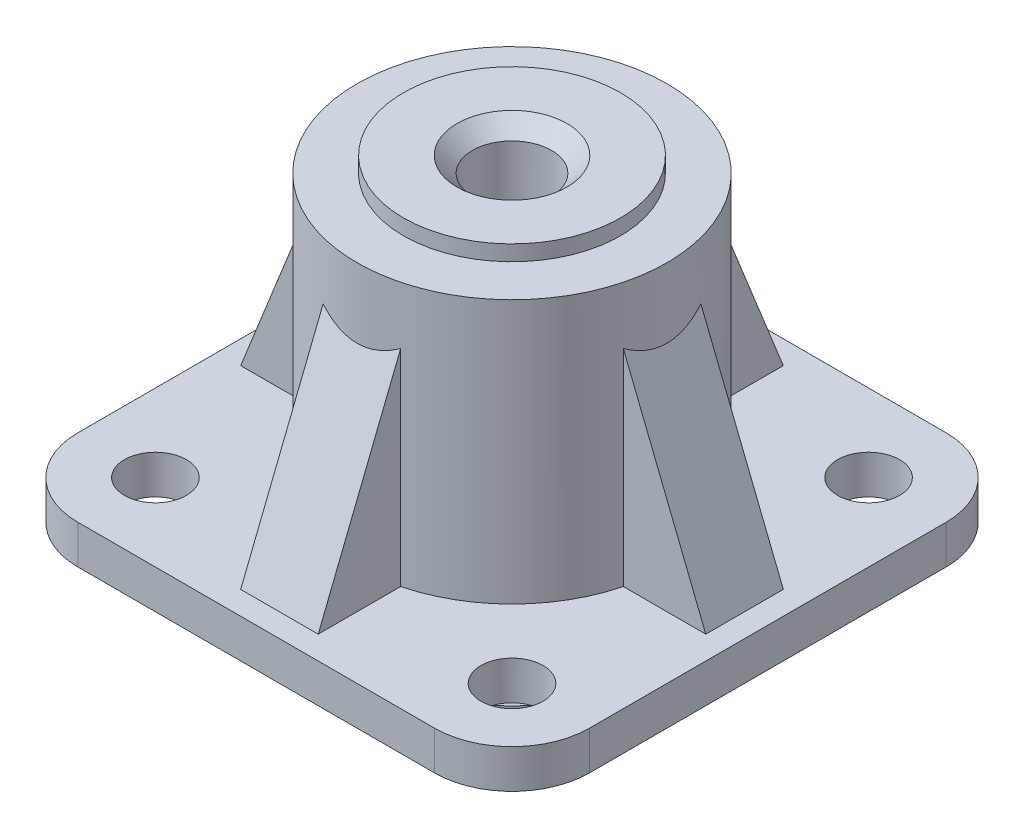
ISO-10303-21;
HEADER;
FILE_DESCRIPTION(('STEP AP214'),'2;1');
FILE_NAME('part.step','',(''),(''),'','','');
FILE_SCHEMA(('AUTOMOTIVE_DESIGN { 1 0 10303 214 1 1 1 1 }'));
ENDSEC;
DATA;
#1=APPLICATION_CONTEXT('core data for automotive mechanical design processes');
#2=APPLICATION_PROTOCOL_DEFINITION('international standard','automotive_design',2000,#1);
#3=PRODUCT_CONTEXT('',#1,'mechanical');
#4=PRODUCT('Part','Part','',(#3));
#5=PRODUCT_RELATED_PRODUCT_CATEGORY('part','',(#4));
#6=PRODUCT_DEFINITION_FORMATION('','',#4);
#7=PRODUCT_DEFINITION_CONTEXT('part definition',#1,'design');
#8=PRODUCT_DEFINITION('design','',#6,#7);
#9=PRODUCT_DEFINITION_SHAPE('','',#8);
#10=(LENGTH_UNIT() NAMED_UNIT(*) SI_UNIT(.MILLI.,.METRE.));
#11=(NAMED_UNIT(*) PLANE_ANGLE_UNIT() SI_UNIT($,.RADIAN.));
#12=(NAMED_UNIT(*) SI_UNIT($,.STERADIAN.) SOLID_ANGLE_UNIT());
#13=UNCERTAINTY_MEASURE_WITH_UNIT(LENGTH_MEASURE(1.E-05),#10,'distance_accuracy_value','');
#14=(GEOMETRIC_REPRESENTATION_CONTEXT(3) GLOBAL_UNCERTAINTY_ASSIGNED_CONTEXT((#13)) GLOBAL_UNIT_ASSIGNED_CONTEXT((#10,
#11,#12)) REPRESENTATION_CONTEXT('',''));
#15=CARTESIAN_POINT('',(0.,0.,0.));
#16=DIRECTION('',(0.,0.,1.));
#17=DIRECTION('',(1.,0.,0.));
#18=AXIS2_PLACEMENT_3D('',#15,#16,#17);
#19=CARTESIAN_POINT('',(-23.,10.,23.));
#20=DIRECTION('',(0.,1.,0.));
#21=DIRECTION('',(0.,0.,1.));
#22=AXIS2_PLACEMENT_3D('',#19,#20,#21);
#23=PLANE('',#22);
#24=CARTESIAN_POINT('',(0.,9.99999999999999,0.));
#25=DIRECTION('',(0.,1.,0.));
#26=DIRECTION('',(0.,0.,1.));
#27=AXIS2_PLACEMENT_3D('',#24,#25,#26);
#28=CIRCLE('',#27,4.005);
#29=CARTESIAN_POINT('',(0.,9.99999999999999,-4.005));
#30=VERTEX_POINT('',#29);
#31=EDGE_CURVE('E659',#30,#30,#28,.F.);
#32=ORIENTED_EDGE('',*,*,#31,.T.);
#33=EDGE_LOOP('',(#32));
#34=FACE_BOUND('',#33,.T.);
#35=CARTESIAN_POINT('',(0.,10.,0.));
#36=DIRECTION('',(0.,1.,0.));
#37=DIRECTION('',(0.,0.,1.));
#38=AXIS2_PLACEMENT_3D('',#35,#36,#37);
#39=CIRCLE('',#38,15.);
#40=CARTESIAN_POINT('',(0.,10.,15.));
#41=VERTEX_POINT('',#40);
#42=EDGE_CURVE('E430',#41,#41,#39,.T.);
#43=ORIENTED_EDGE('',*,*,#42,.T.);
#44=EDGE_LOOP('',(#43));
#45=FACE_BOUND('',#44,.T.);
#46=ADVANCED_FACE('F44',(#34,#45),#23,.T.);
#47=CARTESIAN_POINT('',(10.,30.,0.));
#48=DIRECTION('',(0.,-1.,0.));
#49=DIRECTION('',(0.,0.,-1.));
#50=AXIS2_PLACEMENT_3D('',#47,#48,#49);
#51=PLANE('',#50);
#52=CARTESIAN_POINT('',(0.,30.,0.));
#53=DIRECTION('',(0.,-1.,0.));
#54=DIRECTION('',(0.,0.,-1.));
#55=AXIS2_PLACEMENT_3D('',#52,#53,#54);
#56=CIRCLE('',#55,5.09999999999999);
#57=CARTESIAN_POINT('',(0.,30.,-5.09999999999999));
#58=VERTEX_POINT('',#57);
#59=EDGE_CURVE('E296',#58,#58,#56,.T.);
#60=ORIENTED_EDGE('',*,*,#59,.F.);
#61=EDGE_LOOP('',(#60));
#62=FACE_BOUND('',#61,.T.);
#63=CARTESIAN_POINT('',(0.,30.,0.));
#64=DIRECTION('',(0.,-1.,0.));
#65=DIRECTION('',(0.,0.,-1.));
#66=AXIS2_PLACEMENT_3D('',#63,#64,#65);
#67=CIRCLE('',#66,10.);
#68=CARTESIAN_POINT('',(0.,30.,-10.));
#69=VERTEX_POINT('',#68);
#70=EDGE_CURVE('E395',#69,#69,#67,.T.);
#71=ORIENTED_EDGE('',*,*,#70,.T.);
#72=EDGE_LOOP('',(#71));
#73=FACE_BOUND('',#72,.T.);
#74=ADVANCED_FACE('F474',(#62,#73),#51,.T.);
#75=CARTESIAN_POINT('',(0.,0.,0.));
#76=DIRECTION('',(0.,-1.,0.));
#77=DIRECTION('',(0.,0.,-1.));
#78=AXIS2_PLACEMENT_3D('',#75,#76,#77);
#79=CYLINDRICAL_SURFACE('',#78,10.);
#80=CARTESIAN_POINT('',(0.,34.,0.));
#81=DIRECTION('',(0.,-1.,0.));
#82=DIRECTION('',(0.,0.,-1.));
#83=AXIS2_PLACEMENT_3D('',#80,#81,#82);
#84=CIRCLE('',#83,10.);
#85=CARTESIAN_POINT('',(0.,34.,-10.));
#86=VERTEX_POINT('',#85);
#87=EDGE_CURVE('E398',#86,#86,#84,.T.);
#88=ORIENTED_EDGE('',*,*,#87,.T.);
#89=EDGE_LOOP('',(#88));
#90=FACE_BOUND('',#89,.T.);
#91=ORIENTED_EDGE('',*,*,#70,.F.);
#92=EDGE_LOOP('',(#91));
#93=FACE_BOUND('',#92,.T.);
#94=ADVANCED_FACE('F479',(#90,#93),#79,.T.);
#95=CARTESIAN_POINT('',(10.,34.,0.));
#96=DIRECTION('',(0.,-1.,0.));
#97=DIRECTION('',(0.,0.,-1.));
#98=AXIS2_PLACEMENT_3D('',#95,#96,#97);
#99=PLANE('',#98);
#100=ORIENTED_EDGE('',*,*,#87,.F.);
#101=EDGE_LOOP('',(#100));
#102=FACE_BOUND('',#101,.T.);
#103=CARTESIAN_POINT('',(0.,34.,0.));
#104=DIRECTION('',(0.,-1.,0.));
#105=DIRECTION('',(0.,0.,-1.));
#106=AXIS2_PLACEMENT_3D('',#103,#104,#105);
#107=CIRCLE('',#106,15.);
#108=CARTESIAN_POINT('',(0.,34.,-15.));
#109=VERTEX_POINT('',#108);
#110=EDGE_CURVE('E401',#109,#109,#107,.T.);
#111=ORIENTED_EDGE('',*,*,#110,.T.);
#112=EDGE_LOOP('',(#111));
#113=FACE_BOUND('',#112,.T.);
#114=ADVANCED_FACE('F525',(#102,#113),#99,.T.);
#115=CARTESIAN_POINT('',(0.,0.,0.));
#116=DIRECTION('',(0.,-1.,0.));
#117=DIRECTION('',(0.,0.,-1.));
#118=AXIS2_PLACEMENT_3D('',#115,#116,#117);
#119=CYLINDRICAL_SURFACE('',#118,15.);
#120=ORIENTED_EDGE('',*,*,#42,.F.);
#121=EDGE_LOOP('',(#120));
#122=FACE_BOUND('',#121,.T.);
#123=ORIENTED_EDGE('',*,*,#110,.F.);
#124=EDGE_LOOP('',(#123));
#125=FACE_BOUND('',#124,.T.);
#126=ADVANCED_FACE('F529',(#122,#125),#119,.F.);
#127=CARTESIAN_POINT('',(0.,46.,0.));
#128=DIRECTION('',(0.,1.,0.));
#129=DIRECTION('',(0.,0.,1.));
#130=AXIS2_PLACEMENT_3D('',#127,#128,#129);
#131=CYLINDRICAL_SURFACE('',#130,5.09999999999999);
#132=ORIENTED_EDGE('',*,*,#59,.T.);
#133=EDGE_LOOP('',(#132));
#134=FACE_BOUND('',#133,.T.);
#135=CARTESIAN_POINT('',(0.,44.,0.));
#136=DIRECTION('',(0.,1.,0.));
#137=DIRECTION('',(0.,0.,1.));
#138=AXIS2_PLACEMENT_3D('',#135,#136,#137);
#139=CIRCLE('',#138,5.09999999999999);
#140=CARTESIAN_POINT('',(0.,44.,5.09999999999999));
#141=VERTEX_POINT('',#140);
#142=EDGE_CURVE('E53',#141,#141,#139,.T.);
#143=ORIENTED_EDGE('',*,*,#142,.T.);
#144=EDGE_LOOP('',(#143));
#145=FACE_BOUND('',#144,.T.);
#146=ADVANCED_FACE('F437',(#134,#145),#131,.F.);
#147=CARTESIAN_POINT('',(0.,46.,0.));
#148=DIRECTION('',(0.,1.,0.));
#149=DIRECTION('',(0.,0.,1.));
#150=AXIS2_PLACEMENT_3D('',#147,#148,#149);
#151=PLANE('',#150);
#152=CARTESIAN_POINT('',(0.,46.,0.));
#153=DIRECTION('',(0.,1.,0.));
#154=DIRECTION('',(0.,0.,1.));
#155=AXIS2_PLACEMENT_3D('',#152,#153,#154);
#156=CIRCLE('',#155,7.09999999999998);
#157=CARTESIAN_POINT('',(0.,46.,7.09999999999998));
#158=VERTEX_POINT('',#157);
#159=EDGE_CURVE('E11',#158,#158,#156,.F.);
#160=ORIENTED_EDGE('',*,*,#159,.T.);
#161=EDGE_LOOP('',(#160));
#162=FACE_BOUND('',#161,.T.);
#163=CARTESIAN_POINT('',(0.,46.,0.));
#164=DIRECTION('',(0.,-1.,0.));
#165=DIRECTION('',(0.,0.,-1.));
#166=AXIS2_PLACEMENT_3D('',#163,#164,#165);
#167=CIRCLE('',#166,14.);
#168=CARTESIAN_POINT('',(0.,46.,-14.));
#169=VERTEX_POINT('',#168);
#170=EDGE_CURVE('E427',#169,#169,#167,.T.);
#171=ORIENTED_EDGE('',*,*,#170,.F.);
#172=EDGE_LOOP('',(#171));
#173=FACE_BOUND('',#172,.T.);
#174=ADVANCED_FACE('F445',(#162,#173),#151,.T.);
#175=CARTESIAN_POINT('',(0.,0.,0.));
#176=DIRECTION('',(0.,-1.,0.));
#177=DIRECTION('',(0.,0.,-1.));
#178=AXIS2_PLACEMENT_3D('',#175,#176,#177);
#179=CYLINDRICAL_SURFACE('',#178,14.);
#180=ORIENTED_EDGE('',*,*,#170,.T.);
#181=EDGE_LOOP('',(#180));
#182=FACE_BOUND('',#181,.T.);
#183=CARTESIAN_POINT('',(0.,44.,0.));
#184=DIRECTION('',(0.,-1.,0.));
#185=DIRECTION('',(0.,0.,-1.));
#186=AXIS2_PLACEMENT_3D('',#183,#184,#185);
#187=CIRCLE('',#186,14.);
#188=CARTESIAN_POINT('',(0.,44.,-14.));
#189=VERTEX_POINT('',#188);
#190=EDGE_CURVE('E424',#189,#189,#187,.T.);
#191=ORIENTED_EDGE('',*,*,#190,.F.);
#192=EDGE_LOOP('',(#191));
#193=FACE_BOUND('',#192,.T.);
#194=ADVANCED_FACE('F448',(#182,#193),#179,.T.);
#195=CARTESIAN_POINT('',(14.,44.,0.));
#196=DIRECTION('',(0.,1.,0.));
#197=DIRECTION('',(0.,0.,1.));
#198=AXIS2_PLACEMENT_3D('',#195,#196,#197);
#199=PLANE('',#198);
#200=ORIENTED_EDGE('',*,*,#190,.T.);
#201=EDGE_LOOP('',(#200));
#202=FACE_BOUND('',#201,.T.);
#203=CARTESIAN_POINT('',(0.,44.,0.));
#204=DIRECTION('',(0.,-1.,0.));
#205=DIRECTION('',(0.,0.,-1.));
#206=AXIS2_PLACEMENT_3D('',#203,#204,#205);
#207=CIRCLE('',#206,20.);
#208=CARTESIAN_POINT('',(0.,44.,-20.));
#209=VERTEX_POINT('',#208);
#210=EDGE_CURVE('E420',#209,#209,#207,.T.);
#211=ORIENTED_EDGE('',*,*,#210,.F.);
#212=EDGE_LOOP('',(#211));
#213=FACE_BOUND('',#212,.T.);
#214=ADVANCED_FACE('F453',(#202,#213),#199,.T.);
#215=CARTESIAN_POINT('',(0.,0.,0.));
#216=DIRECTION('',(0.,-1.,0.));
#217=DIRECTION('',(0.,0.,-1.));
#218=AXIS2_PLACEMENT_3D('',#215,#216,#217);
#219=CYLINDRICAL_SURFACE('',#218,20.);
#220=DIRECTION('',(0.,-1.,0.));
#221=VECTOR('',#220,1.);
#222=CARTESIAN_POINT('',(5.00000000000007,0.,-19.3649167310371));
#223=LINE('',#222,#221);
#224=CARTESIAN_POINT('',(5.00000000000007,10.,-19.3649167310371));
#225=VERTEX_POINT('',#224);
#226=CARTESIAN_POINT('',(5.00000000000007,36.5896050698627,-19.3649167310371));
#227=VERTEX_POINT('',#226);
#228=EDGE_CURVE('E264',#225,#227,#223,.F.);
#229=ORIENTED_EDGE('',*,*,#228,.T.);
#230=CARTESIAN_POINT('',(0.,85.0053508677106,0.));
#231=DIRECTION('',(0.,-0.371367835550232,0.928485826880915));
#232=DIRECTION('',(0.,-0.928485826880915,-0.371367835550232));
#233=AXIS2_PLACEMENT_3D('',#230,#231,#232);
#234=ELLIPSE('',#233,53.8549601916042,20.);
#235=CARTESIAN_POINT('',(-4.99999999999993,36.5896050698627,-19.3649167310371));
#236=VERTEX_POINT('',#235);
#237=EDGE_CURVE('E273',#236,#227,#234,.T.);
#238=ORIENTED_EDGE('',*,*,#237,.F.);
#239=DIRECTION('',(0.,-1.,0.));
#240=VECTOR('',#239,1.);
#241=CARTESIAN_POINT('',(-4.99999999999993,0.,-19.3649167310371));
#242=LINE('',#241,#240);
#243=CARTESIAN_POINT('',(-4.99999999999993,10.,-19.3649167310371));
#244=VERTEX_POINT('',#243);
#245=EDGE_CURVE('E269',#244,#236,#242,.F.);
#246=ORIENTED_EDGE('',*,*,#245,.F.);
#247=CARTESIAN_POINT('',(0.,10.,0.));
#248=DIRECTION('',(0.,1.,0.));
#249=DIRECTION('',(0.,0.,1.));
#250=AXIS2_PLACEMENT_3D('',#247,#248,#249);
#251=CIRCLE('',#250,20.);
#252=CARTESIAN_POINT('',(-19.3649167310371,10.,-5.));
#253=VERTEX_POINT('',#252);
#254=EDGE_CURVE('E390',#253,#244,#251,.F.);
#255=ORIENTED_EDGE('',*,*,#254,.F.);
#256=DIRECTION('',(0.,-1.,0.));
#257=VECTOR('',#256,1.);
#258=CARTESIAN_POINT('',(-19.3649167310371,0.,-5.));
#259=LINE('',#258,#257);
#260=CARTESIAN_POINT('',(-19.3649167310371,36.5896050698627,-5.));
#261=VERTEX_POINT('',#260);
#262=EDGE_CURVE('E284',#253,#261,#259,.F.);
#263=ORIENTED_EDGE('',*,*,#262,.T.);
#264=CARTESIAN_POINT('',(0.,85.0053508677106,0.));
#265=DIRECTION('',(0.928485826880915,-0.371367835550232,0.));
#266=DIRECTION('',(-0.371367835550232,-0.928485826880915,0.));
#267=AXIS2_PLACEMENT_3D('',#264,#265,#266);
#268=ELLIPSE('',#267,53.8549601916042,20.);
#269=CARTESIAN_POINT('',(-19.3649167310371,36.5896050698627,5.));
#270=VERTEX_POINT('',#269);
#271=EDGE_CURVE('E294',#270,#261,#268,.T.);
#272=ORIENTED_EDGE('',*,*,#271,.F.);
#273=DIRECTION('',(0.,-1.,0.));
#274=VECTOR('',#273,1.);
#275=CARTESIAN_POINT('',(-19.3649167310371,0.,5.));
#276=LINE('',#275,#274);
#277=CARTESIAN_POINT('',(-19.3649167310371,10.,5.));
#278=VERTEX_POINT('',#277);
#279=EDGE_CURVE('E290',#278,#270,#276,.F.);
#280=ORIENTED_EDGE('',*,*,#279,.F.);
#281=CARTESIAN_POINT('',(-5.0000000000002,10.,19.364916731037));
#282=VERTEX_POINT('',#281);
#283=EDGE_CURVE('E394',#282,#278,#251,.F.);
#284=ORIENTED_EDGE('',*,*,#283,.F.);
#285=DIRECTION('',(0.,-1.,0.));
#286=VECTOR('',#285,1.);
#287=CARTESIAN_POINT('',(-5.0000000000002,0.,19.364916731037));
#288=LINE('',#287,#286);
#289=CARTESIAN_POINT('',(-5.0000000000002,36.5896050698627,19.364916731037));
#290=VERTEX_POINT('',#289);
#291=EDGE_CURVE('E60',#282,#290,#288,.F.);
#292=ORIENTED_EDGE('',*,*,#291,.T.);
#293=CARTESIAN_POINT('',(0.,85.0053508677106,0.));
#294=DIRECTION('',(0.,-0.371367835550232,-0.928485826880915));
#295=DIRECTION('',(0.,-0.928485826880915,0.371367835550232));
#296=AXIS2_PLACEMENT_3D('',#293,#294,#295);
#297=ELLIPSE('',#296,53.8549601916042,20.);
#298=CARTESIAN_POINT('',(4.9999999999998,36.5896050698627,19.3649167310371));
#299=VERTEX_POINT('',#298);
#300=EDGE_CURVE('E217',#299,#290,#297,.T.);
#301=ORIENTED_EDGE('',*,*,#300,.F.);
#302=DIRECTION('',(0.,-1.,0.));
#303=VECTOR('',#302,1.);
#304=CARTESIAN_POINT('',(4.9999999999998,0.,19.3649167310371));
#305=LINE('',#304,#303);
#306=CARTESIAN_POINT('',(4.9999999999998,10.,19.3649167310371));
#307=VERTEX_POINT('',#306);
#308=EDGE_CURVE('E223',#307,#299,#305,.F.);
#309=ORIENTED_EDGE('',*,*,#308,.F.);
#310=CARTESIAN_POINT('',(19.3649167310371,10.,5.));
#311=VERTEX_POINT('',#310);
#312=EDGE_CURVE('E230',#311,#307,#251,.F.);
#313=ORIENTED_EDGE('',*,*,#312,.F.);
#314=DIRECTION('',(0.,-1.,0.));
#315=VECTOR('',#314,1.);
#316=CARTESIAN_POINT('',(19.3649167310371,0.,5.));
#317=LINE('',#316,#315);
#318=CARTESIAN_POINT('',(19.3649167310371,36.5896050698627,5.));
#319=VERTEX_POINT('',#318);
#320=EDGE_CURVE('E68',#311,#319,#317,.F.);
#321=ORIENTED_EDGE('',*,*,#320,.T.);
#322=CARTESIAN_POINT('',(0.,85.0053508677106,0.));
#323=DIRECTION('',(-0.928485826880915,-0.371367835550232,0.));
#324=DIRECTION('',(0.371367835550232,-0.928485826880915,0.));
#325=AXIS2_PLACEMENT_3D('',#322,#323,#324);
#326=ELLIPSE('',#325,53.8549601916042,20.);
#327=CARTESIAN_POINT('',(19.3649167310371,36.5896050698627,-5.));
#328=VERTEX_POINT('',#327);
#329=EDGE_CURVE('E253',#328,#319,#326,.T.);
#330=ORIENTED_EDGE('',*,*,#329,.F.);
#331=DIRECTION('',(0.,-1.,0.));
#332=VECTOR('',#331,1.);
#333=CARTESIAN_POINT('',(19.3649167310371,0.,-5.));
#334=LINE('',#333,#332);
#335=CARTESIAN_POINT('',(19.3649167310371,10.,-5.));
#336=VERTEX_POINT('',#335);
#337=EDGE_CURVE('E246',#336,#328,#334,.F.);
#338=ORIENTED_EDGE('',*,*,#337,.F.);
#339=EDGE_CURVE('E393',#225,#336,#251,.F.);
#340=ORIENTED_EDGE('',*,*,#339,.F.);
#341=EDGE_LOOP('',(#229,#238,#246,#255,#263,#272,#280,#284,#292,#301,#309,#313,#321,#330,#338,#340));
#342=FACE_BOUND('',#341,.T.);
#343=ORIENTED_EDGE('',*,*,#210,.T.);
#344=EDGE_LOOP('',(#343));
#345=FACE_BOUND('',#344,.T.);
#346=ADVANCED_FACE('F459',(#342,#345),#219,.T.);
#347=DIRECTION('',(-1.,0.,0.));
#348=VECTOR('',#347,1.);
#349=CARTESIAN_POINT('',(-22.9999999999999,10.,-33.));
#350=LINE('',#349,#348);
#351=CARTESIAN_POINT('',(22.9999999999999,10.,-33.));
#352=VERTEX_POINT('',#351);
#353=CARTESIAN_POINT('',(-22.9999999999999,10.,-33.));
#354=VERTEX_POINT('',#353);
#355=EDGE_CURVE('E340',#352,#354,#350,.T.);
#356=ORIENTED_EDGE('',*,*,#355,.T.);
#357=CARTESIAN_POINT('',(-23.,10.,-23.));
#358=DIRECTION('',(0.,1.,0.));
#359=DIRECTION('',(0.,0.,1.));
#360=AXIS2_PLACEMENT_3D('',#357,#358,#359);
#361=CIRCLE('',#360,10.);
#362=CARTESIAN_POINT('',(-33.,10.,-22.9999999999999));
#363=VERTEX_POINT('',#362);
#364=EDGE_CURVE('E342',#354,#363,#361,.T.);
#365=ORIENTED_EDGE('',*,*,#364,.T.);
#366=DIRECTION('',(0.,0.,1.));
#367=VECTOR('',#366,1.);
#368=CARTESIAN_POINT('',(-33.,10.,-22.9999999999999));
#369=LINE('',#368,#367);
#370=CARTESIAN_POINT('',(-33.,10.,22.9999999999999));
#371=VERTEX_POINT('',#370);
#372=EDGE_CURVE('E344',#363,#371,#369,.T.);
#373=ORIENTED_EDGE('',*,*,#372,.T.);
#374=CARTESIAN_POINT('',(-23.,10.,23.));
#375=DIRECTION('',(0.,1.,0.));
#376=DIRECTION('',(0.,0.,1.));
#377=AXIS2_PLACEMENT_3D('',#374,#375,#376);
#378=CIRCLE('',#377,10.);
#379=CARTESIAN_POINT('',(-22.9999999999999,10.,33.));
#380=VERTEX_POINT('',#379);
#381=EDGE_CURVE('E328',#371,#380,#378,.T.);
#382=ORIENTED_EDGE('',*,*,#381,.T.);
#383=DIRECTION('',(1.,0.,0.));
#384=VECTOR('',#383,1.);
#385=CARTESIAN_POINT('',(-22.9999999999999,10.,33.));
#386=LINE('',#385,#384);
#387=CARTESIAN_POINT('',(22.9999999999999,10.,33.));
#388=VERTEX_POINT('',#387);
#389=EDGE_CURVE('E331',#380,#388,#386,.T.);
#390=ORIENTED_EDGE('',*,*,#389,.T.);
#391=CARTESIAN_POINT('',(23.,10.,23.));
#392=DIRECTION('',(0.,1.,0.));
#393=DIRECTION('',(0.,0.,1.));
#394=AXIS2_PLACEMENT_3D('',#391,#392,#393);
#395=CIRCLE('',#394,10.);
#396=CARTESIAN_POINT('',(33.,10.,22.9999999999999));
#397=VERTEX_POINT('',#396);
#398=EDGE_CURVE('E334',#388,#397,#395,.T.);
#399=ORIENTED_EDGE('',*,*,#398,.T.);
#400=DIRECTION('',(0.,0.,-1.));
#401=VECTOR('',#400,1.);
#402=CARTESIAN_POINT('',(33.,10.,-22.9999999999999));
#403=LINE('',#402,#401);
#404=CARTESIAN_POINT('',(33.,10.,-22.9999999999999));
#405=VERTEX_POINT('',#404);
#406=EDGE_CURVE('E336',#397,#405,#403,.T.);
#407=ORIENTED_EDGE('',*,*,#406,.T.);
#408=CARTESIAN_POINT('',(23.,10.,-23.));
#409=DIRECTION('',(0.,1.,0.));
#410=DIRECTION('',(0.,0.,-1.));
#411=AXIS2_PLACEMENT_3D('',#408,#409,#410);
#412=CIRCLE('',#411,10.);
#413=EDGE_CURVE('E338',#405,#352,#412,.T.);
#414=ORIENTED_EDGE('',*,*,#413,.T.);
#415=EDGE_LOOP('',(#356,#365,#373,#382,#390,#399,#407,#414));
#416=FACE_BOUND('',#415,.T.);
#417=DIRECTION('',(1.,0.,0.));
#418=VECTOR('',#417,1.);
#419=CARTESIAN_POINT('',(-22.9999999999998,10.,-30.0000000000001));
#420=LINE('',#419,#418);
#421=CARTESIAN_POINT('',(5.0000000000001,10.,-30.));
#422=VERTEX_POINT('',#421);
#423=CARTESIAN_POINT('',(-4.9999999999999,10.,-30.));
#424=VERTEX_POINT('',#423);
#425=EDGE_CURVE('E271',#422,#424,#420,.F.);
#426=ORIENTED_EDGE('',*,*,#425,.F.);
#427=DIRECTION('',(0.,0.,1.));
#428=VECTOR('',#427,1.);
#429=CARTESIAN_POINT('',(4.99999999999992,10.,23.0000000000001));
#430=LINE('',#429,#428);
#431=EDGE_CURVE('E259',#422,#225,#430,.T.);
#432=ORIENTED_EDGE('',*,*,#431,.T.);
#433=ORIENTED_EDGE('',*,*,#339,.T.);
#434=DIRECTION('',(-1.,0.,0.));
#435=VECTOR('',#434,1.);
#436=CARTESIAN_POINT('',(-23.,10.,-5.));
#437=LINE('',#436,#435);
#438=CARTESIAN_POINT('',(30.,10.,-5.));
#439=VERTEX_POINT('',#438);
#440=EDGE_CURVE('E243',#439,#336,#437,.T.);
#441=ORIENTED_EDGE('',*,*,#440,.F.);
#442=DIRECTION('',(0.,0.,1.));
#443=VECTOR('',#442,1.);
#444=CARTESIAN_POINT('',(30.,10.,23.));
#445=LINE('',#444,#443);
#446=CARTESIAN_POINT('',(30.,10.,5.));
#447=VERTEX_POINT('',#446);
#448=EDGE_CURVE('E251',#447,#439,#445,.F.);
#449=ORIENTED_EDGE('',*,*,#448,.F.);
#450=DIRECTION('',(-1.,0.,0.));
#451=VECTOR('',#450,1.);
#452=CARTESIAN_POINT('',(-23.,10.,5.));
#453=LINE('',#452,#451);
#454=EDGE_CURVE('E248',#447,#311,#453,.T.);
#455=ORIENTED_EDGE('',*,*,#454,.T.);
#456=ORIENTED_EDGE('',*,*,#312,.T.);
#457=DIRECTION('',(0.,0.,-1.));
#458=VECTOR('',#457,1.);
#459=CARTESIAN_POINT('',(4.99999999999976,10.,23.0000000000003));
#460=LINE('',#459,#458);
#461=CARTESIAN_POINT('',(4.99999999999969,10.,30.));
#462=VERTEX_POINT('',#461);
#463=EDGE_CURVE('E221',#462,#307,#460,.T.);
#464=ORIENTED_EDGE('',*,*,#463,.F.);
#465=DIRECTION('',(-1.,0.,0.));
#466=VECTOR('',#465,1.);
#467=CARTESIAN_POINT('',(-23.0000000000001,10.,29.9999999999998));
#468=LINE('',#467,#466);
#469=CARTESIAN_POINT('',(-5.00000000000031,10.,29.9999999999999));
#470=VERTEX_POINT('',#469);
#471=EDGE_CURVE('E209',#470,#462,#468,.F.);
#472=ORIENTED_EDGE('',*,*,#471,.F.);
#473=DIRECTION('',(0.,0.,-1.));
#474=VECTOR('',#473,1.);
#475=CARTESIAN_POINT('',(-5.00000000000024,10.,23.0000000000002));
#476=LINE('',#475,#474);
#477=EDGE_CURVE('E232',#470,#282,#476,.T.);
#478=ORIENTED_EDGE('',*,*,#477,.T.);
#479=ORIENTED_EDGE('',*,*,#283,.T.);
#480=DIRECTION('',(1.,0.,0.));
#481=VECTOR('',#480,1.);
#482=CARTESIAN_POINT('',(-23.,10.,5.));
#483=LINE('',#482,#481);
#484=CARTESIAN_POINT('',(-30.,10.,5.));
#485=VERTEX_POINT('',#484);
#486=EDGE_CURVE('E287',#485,#278,#483,.T.);
#487=ORIENTED_EDGE('',*,*,#486,.F.);
#488=DIRECTION('',(0.,0.,-1.));
#489=VECTOR('',#488,1.);
#490=CARTESIAN_POINT('',(-30.,10.,23.));
#491=LINE('',#490,#489);
#492=CARTESIAN_POINT('',(-30.,10.,-5.));
#493=VERTEX_POINT('',#492);
#494=EDGE_CURVE('E292',#493,#485,#491,.F.);
#495=ORIENTED_EDGE('',*,*,#494,.F.);
#496=DIRECTION('',(1.,0.,0.));
#497=VECTOR('',#496,1.);
#498=CARTESIAN_POINT('',(-23.,10.,-5.));
#499=LINE('',#498,#497);
#500=EDGE_CURVE('E279',#493,#253,#499,.T.);
#501=ORIENTED_EDGE('',*,*,#500,.T.);
#502=ORIENTED_EDGE('',*,*,#254,.T.);
#503=DIRECTION('',(0.,0.,1.));
#504=VECTOR('',#503,1.);
#505=CARTESIAN_POINT('',(-5.00000000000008,10.,23.0000000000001));
#506=LINE('',#505,#504);
#507=EDGE_CURVE('E267',#424,#244,#506,.T.);
#508=ORIENTED_EDGE('',*,*,#507,.F.);
#509=EDGE_LOOP('',(#426,#432,#433,#441,#449,#455,#456,#464,#472,#478,#479,#487,#495,#501,#502,#508));
#510=FACE_BOUND('',#509,.T.);
#511=CARTESIAN_POINT('',(23.,10.,23.));
#512=DIRECTION('',(0.,1.,0.));
#513=DIRECTION('',(0.,0.,1.));
#514=AXIS2_PLACEMENT_3D('',#511,#512,#513);
#515=CIRCLE('',#514,4.);
#516=CARTESIAN_POINT('',(23.,10.,27.));
#517=VERTEX_POINT('',#516);
#518=EDGE_CURVE('E300',#517,#517,#515,.T.);
#519=ORIENTED_EDGE('',*,*,#518,.F.);
#520=EDGE_LOOP('',(#519));
#521=FACE_BOUND('',#520,.T.);
#522=CARTESIAN_POINT('',(23.,10.,-23.));
#523=DIRECTION('',(0.,1.,0.));
#524=DIRECTION('',(0.,0.,1.));
#525=AXIS2_PLACEMENT_3D('',#522,#523,#524);
#526=CIRCLE('',#525,4.);
#527=CARTESIAN_POINT('',(23.,10.,-19.));
#528=VERTEX_POINT('',#527);
#529=EDGE_CURVE('E314',#528,#528,#526,.T.);
#530=ORIENTED_EDGE('',*,*,#529,.F.);
#531=EDGE_LOOP('',(#530));
#532=FACE_BOUND('',#531,.T.);
#533=CARTESIAN_POINT('',(-23.,10.,-23.));
#534=DIRECTION('',(0.,1.,0.));
#535=DIRECTION('',(0.,0.,1.));
#536=AXIS2_PLACEMENT_3D('',#533,#534,#535);
#537=CIRCLE('',#536,4.);
#538=CARTESIAN_POINT('',(-23.,10.,-19.));
#539=VERTEX_POINT('',#538);
#540=EDGE_CURVE('E321',#539,#539,#537,.T.);
#541=ORIENTED_EDGE('',*,*,#540,.F.);
#542=EDGE_LOOP('',(#541));
#543=FACE_BOUND('',#542,.T.);
#544=CARTESIAN_POINT('',(-23.,10.,23.));
#545=DIRECTION('',(0.,1.,0.));
#546=DIRECTION('',(0.,0.,1.));
#547=AXIS2_PLACEMENT_3D('',#544,#545,#546);
#548=CIRCLE('',#547,4.);
#549=CARTESIAN_POINT('',(-23.,10.,27.));
#550=VERTEX_POINT('',#549);
#551=EDGE_CURVE('E307',#550,#550,#548,.T.);
#552=ORIENTED_EDGE('',*,*,#551,.F.);
#553=EDGE_LOOP('',(#552));
#554=FACE_BOUND('',#553,.T.);
#555=ADVANCED_FACE('F227',(#416,#510,#521,#532,#543,#554),#23,.T.);
#556=CARTESIAN_POINT('',(-23.,5.,23.));
#557=DIRECTION('',(0.,1.,0.));
#558=DIRECTION('',(0.,0.,1.));
#559=AXIS2_PLACEMENT_3D('',#556,#557,#558);
#560=PLANE('',#559);
#561=CARTESIAN_POINT('',(-23.,5.,23.));
#562=DIRECTION('',(0.,1.,0.));
#563=DIRECTION('',(0.,0.,1.));
#564=AXIS2_PLACEMENT_3D('',#561,#562,#563);
#565=CIRCLE('',#564,4.);
#566=CARTESIAN_POINT('',(-21.7267138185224,5.,19.2080687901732));
#567=VERTEX_POINT('',#566);
#568=CARTESIAN_POINT('',(-19.2080687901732,5.,21.7267138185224));
#569=VERTEX_POINT('',#568);
#570=EDGE_CURVE('E303',#567,#569,#565,.T.);
#571=ORIENTED_EDGE('',*,*,#570,.T.);
#572=CARTESIAN_POINT('',(0.,5.,0.));
#573=DIRECTION('',(0.,1.,0.));
#574=DIRECTION('',(0.,0.,1.));
#575=AXIS2_PLACEMENT_3D('',#572,#573,#574);
#576=CIRCLE('',#575,29.);
#577=CARTESIAN_POINT('',(19.2080687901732,5.,21.7267138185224));
#578=VERTEX_POINT('',#577);
#579=EDGE_CURVE('E386',#578,#569,#576,.F.);
#580=ORIENTED_EDGE('',*,*,#579,.F.);
#581=CARTESIAN_POINT('',(23.,5.,23.));
#582=DIRECTION('',(0.,1.,0.));
#583=DIRECTION('',(0.,0.,1.));
#584=AXIS2_PLACEMENT_3D('',#581,#582,#583);
#585=CIRCLE('',#584,4.);
#586=CARTESIAN_POINT('',(21.7267138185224,5.,19.2080687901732));
#587=VERTEX_POINT('',#586);
#588=EDGE_CURVE('E299',#578,#587,#585,.T.);
#589=ORIENTED_EDGE('',*,*,#588,.T.);
#590=CARTESIAN_POINT('',(21.7267138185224,5.,-19.2080687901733));
#591=VERTEX_POINT('',#590);
#592=EDGE_CURVE('E388',#591,#587,#576,.F.);
#593=ORIENTED_EDGE('',*,*,#592,.F.);
#594=CARTESIAN_POINT('',(23.,5.,-23.));
#595=DIRECTION('',(0.,1.,0.));
#596=DIRECTION('',(0.,0.,1.));
#597=AXIS2_PLACEMENT_3D('',#594,#595,#596);
#598=CIRCLE('',#597,4.);
#599=CARTESIAN_POINT('',(19.2080687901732,5.,-21.7267138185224));
#600=VERTEX_POINT('',#599);
#601=EDGE_CURVE('E310',#591,#600,#598,.T.);
#602=ORIENTED_EDGE('',*,*,#601,.T.);
#603=CARTESIAN_POINT('',(-19.2080687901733,5.,-21.7267138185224));
#604=VERTEX_POINT('',#603);
#605=EDGE_CURVE('E580',#604,#600,#576,.F.);
#606=ORIENTED_EDGE('',*,*,#605,.F.);
#607=CARTESIAN_POINT('',(-23.,5.,-23.));
#608=DIRECTION('',(0.,1.,0.));
#609=DIRECTION('',(0.,0.,1.));
#610=AXIS2_PLACEMENT_3D('',#607,#608,#609);
#611=CIRCLE('',#610,4.);
#612=CARTESIAN_POINT('',(-21.7267138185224,5.,-19.2080687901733));
#613=VERTEX_POINT('',#612);
#614=EDGE_CURVE('E317',#604,#613,#611,.T.);
#615=ORIENTED_EDGE('',*,*,#614,.T.);
#616=EDGE_CURVE('E389',#567,#613,#576,.F.);
#617=ORIENTED_EDGE('',*,*,#616,.F.);
#618=EDGE_LOOP('',(#571,#580,#589,#593,#602,#606,#615,#617));
#619=FACE_BOUND('',#618,.T.);
#620=CARTESIAN_POINT('',(-23.,5.,-23.));
#621=DIRECTION('',(0.,1.,0.));
#622=DIRECTION('',(0.,0.,1.));
#623=AXIS2_PLACEMENT_3D('',#620,#621,#622);
#624=CIRCLE('',#623,10.);
#625=CARTESIAN_POINT('',(-22.9999999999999,5.,-33.));
#626=VERTEX_POINT('',#625);
#627=CARTESIAN_POINT('',(-33.,5.,-22.9999999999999));
#628=VERTEX_POINT('',#627);
#629=EDGE_CURVE('E359',#626,#628,#624,.T.);
#630=ORIENTED_EDGE('',*,*,#629,.F.);
#631=DIRECTION('',(-1.,0.,0.));
#632=VECTOR('',#631,1.);
#633=CARTESIAN_POINT('',(-22.9999999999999,5.,-33.));
#634=LINE('',#633,#632);
#635=CARTESIAN_POINT('',(22.9999999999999,5.,-33.));
#636=VERTEX_POINT('',#635);
#637=EDGE_CURVE('E357',#636,#626,#634,.T.);
#638=ORIENTED_EDGE('',*,*,#637,.F.);
#639=CARTESIAN_POINT('',(23.,5.,-23.));
#640=DIRECTION('',(0.,1.,0.));
#641=DIRECTION('',(0.,0.,-1.));
#642=AXIS2_PLACEMENT_3D('',#639,#640,#641);
#643=CIRCLE('',#642,10.);
#644=CARTESIAN_POINT('',(33.,5.,-22.9999999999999));
#645=VERTEX_POINT('',#644);
#646=EDGE_CURVE('E355',#645,#636,#643,.T.);
#647=ORIENTED_EDGE('',*,*,#646,.F.);
#648=DIRECTION('',(0.,0.,-1.));
#649=VECTOR('',#648,1.);
#650=CARTESIAN_POINT('',(33.,5.,-22.9999999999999));
#651=LINE('',#650,#649);
#652=CARTESIAN_POINT('',(33.,5.,22.9999999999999));
#653=VERTEX_POINT('',#652);
#654=EDGE_CURVE('E353',#653,#645,#651,.T.);
#655=ORIENTED_EDGE('',*,*,#654,.F.);
#656=CARTESIAN_POINT('',(23.,5.,23.));
#657=DIRECTION('',(0.,1.,0.));
#658=DIRECTION('',(0.,0.,1.));
#659=AXIS2_PLACEMENT_3D('',#656,#657,#658);
#660=CIRCLE('',#659,10.);
#661=CARTESIAN_POINT('',(22.9999999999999,5.,33.));
#662=VERTEX_POINT('',#661);
#663=EDGE_CURVE('E351',#662,#653,#660,.T.);
#664=ORIENTED_EDGE('',*,*,#663,.F.);
#665=DIRECTION('',(1.,0.,0.));
#666=VECTOR('',#665,1.);
#667=CARTESIAN_POINT('',(-22.9999999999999,5.,33.));
#668=LINE('',#667,#666);
#669=CARTESIAN_POINT('',(-22.9999999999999,5.,33.));
#670=VERTEX_POINT('',#669);
#671=EDGE_CURVE('E349',#670,#662,#668,.T.);
#672=ORIENTED_EDGE('',*,*,#671,.F.);
#673=CARTESIAN_POINT('',(-23.,5.,23.));
#674=DIRECTION('',(0.,1.,0.));
#675=DIRECTION('',(0.,0.,1.));
#676=AXIS2_PLACEMENT_3D('',#673,#674,#675);
#677=CIRCLE('',#676,10.);
#678=CARTESIAN_POINT('',(-33.,5.,22.9999999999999));
#679=VERTEX_POINT('',#678);
#680=EDGE_CURVE('E324',#679,#670,#677,.T.);
#681=ORIENTED_EDGE('',*,*,#680,.F.);
#682=DIRECTION('',(0.,0.,1.));
#683=VECTOR('',#682,1.);
#684=CARTESIAN_POINT('',(-33.,5.,-22.9999999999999));
#685=LINE('',#684,#683);
#686=EDGE_CURVE('E332',#628,#679,#685,.T.);
#687=ORIENTED_EDGE('',*,*,#686,.F.);
#688=EDGE_LOOP('',(#630,#638,#647,#655,#664,#672,#681,#687));
#689=FACE_BOUND('',#688,.T.);
#690=ADVANCED_FACE('F469',(#619,#689),#560,.F.);
#691=CARTESIAN_POINT('',(-23.,10.,23.));
#692=DIRECTION('',(0.,-1.,0.));
#693=DIRECTION('',(0.,0.,-1.));
#694=AXIS2_PLACEMENT_3D('',#691,#692,#693);
#695=CYLINDRICAL_SURFACE('',#694,10.);
#696=ORIENTED_EDGE('',*,*,#680,.T.);
#697=DIRECTION('',(0.,-1.,0.));
#698=VECTOR('',#697,1.);
#699=CARTESIAN_POINT('',(-22.9999999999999,10.,33.));
#700=LINE('',#699,#698);
#701=EDGE_CURVE('E382',#380,#670,#700,.T.);
#702=ORIENTED_EDGE('',*,*,#701,.F.);
#703=ORIENTED_EDGE('',*,*,#381,.F.);
#704=DIRECTION('',(0.,-1.,0.));
#705=VECTOR('',#704,1.);
#706=CARTESIAN_POINT('',(-33.,10.,22.9999999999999));
#707=LINE('',#706,#705);
#708=EDGE_CURVE('E346',#371,#679,#707,.T.);
#709=ORIENTED_EDGE('',*,*,#708,.T.);
#710=EDGE_LOOP('',(#696,#702,#703,#709));
#711=FACE_BOUND('',#710,.T.);
#712=ADVANCED_FACE('F490',(#711),#695,.T.);
#713=CARTESIAN_POINT('',(-22.9999999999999,10.,33.));
#714=DIRECTION('',(0.,0.,-1.));
#715=DIRECTION('',(-1.,0.,0.));
#716=AXIS2_PLACEMENT_3D('',#713,#714,#715);
#717=PLANE('',#716);
#718=ORIENTED_EDGE('',*,*,#671,.T.);
#719=DIRECTION('',(0.,-1.,0.));
#720=VECTOR('',#719,1.);
#721=CARTESIAN_POINT('',(22.9999999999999,10.,33.));
#722=LINE('',#721,#720);
#723=EDGE_CURVE('E379',#388,#662,#722,.T.);
#724=ORIENTED_EDGE('',*,*,#723,.F.);
#725=ORIENTED_EDGE('',*,*,#389,.F.);
#726=ORIENTED_EDGE('',*,*,#701,.T.);
#727=EDGE_LOOP('',(#718,#724,#725,#726));
#728=FACE_BOUND('',#727,.T.);
#729=ADVANCED_FACE('F515',(#728),#717,.F.);
#730=CARTESIAN_POINT('',(23.,10.,23.));
#731=DIRECTION('',(0.,-1.,0.));
#732=DIRECTION('',(0.,0.,-1.));
#733=AXIS2_PLACEMENT_3D('',#730,#731,#732);
#734=CYLINDRICAL_SURFACE('',#733,10.);
#735=ORIENTED_EDGE('',*,*,#663,.T.);
#736=DIRECTION('',(0.,-1.,0.));
#737=VECTOR('',#736,1.);
#738=CARTESIAN_POINT('',(33.,10.,22.9999999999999));
#739=LINE('',#738,#737);
#740=EDGE_CURVE('E376',#397,#653,#739,.T.);
#741=ORIENTED_EDGE('',*,*,#740,.F.);
#742=ORIENTED_EDGE('',*,*,#398,.F.);
#743=ORIENTED_EDGE('',*,*,#723,.T.);
#744=EDGE_LOOP('',(#735,#741,#742,#743));
#745=FACE_BOUND('',#744,.T.);
#746=ADVANCED_FACE('F511',(#745),#734,.T.);
#747=CARTESIAN_POINT('',(33.,10.,-22.9999999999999));
#748=DIRECTION('',(-1.,0.,0.));
#749=DIRECTION('',(0.,0.,1.));
#750=AXIS2_PLACEMENT_3D('',#747,#748,#749);
#751=PLANE('',#750);
#752=ORIENTED_EDGE('',*,*,#654,.T.);
#753=DIRECTION('',(0.,-1.,0.));
#754=VECTOR('',#753,1.);
#755=CARTESIAN_POINT('',(33.,10.,-22.9999999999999));
#756=LINE('',#755,#754);
#757=EDGE_CURVE('E373',#405,#645,#756,.T.);
#758=ORIENTED_EDGE('',*,*,#757,.F.);
#759=ORIENTED_EDGE('',*,*,#406,.F.);
#760=ORIENTED_EDGE('',*,*,#740,.T.);
#761=EDGE_LOOP('',(#752,#758,#759,#760));
#762=FACE_BOUND('',#761,.T.);
#763=ADVANCED_FACE('F507',(#762),#751,.F.);
#764=CARTESIAN_POINT('',(23.,10.,-23.));
#765=DIRECTION('',(0.,-1.,0.));
#766=DIRECTION('',(0.,0.,-1.));
#767=AXIS2_PLACEMENT_3D('',#764,#765,#766);
#768=CYLINDRICAL_SURFACE('',#767,10.);
#769=ORIENTED_EDGE('',*,*,#646,.T.);
#770=DIRECTION('',(0.,-1.,0.));
#771=VECTOR('',#770,1.);
#772=CARTESIAN_POINT('',(22.9999999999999,10.,-33.));
#773=LINE('',#772,#771);
#774=EDGE_CURVE('E370',#352,#636,#773,.T.);
#775=ORIENTED_EDGE('',*,*,#774,.F.);
#776=ORIENTED_EDGE('',*,*,#413,.F.);
#777=ORIENTED_EDGE('',*,*,#757,.T.);
#778=EDGE_LOOP('',(#769,#775,#776,#777));
#779=FACE_BOUND('',#778,.T.);
#780=ADVANCED_FACE('F503',(#779),#768,.T.);
#781=CARTESIAN_POINT('',(-22.9999999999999,10.,-33.));
#782=DIRECTION('',(0.,0.,1.));
#783=DIRECTION('',(1.,0.,0.));
#784=AXIS2_PLACEMENT_3D('',#781,#782,#783);
#785=PLANE('',#784);
#786=ORIENTED_EDGE('',*,*,#637,.T.);
#787=DIRECTION('',(0.,-1.,0.));
#788=VECTOR('',#787,1.);
#789=CARTESIAN_POINT('',(-22.9999999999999,10.,-33.));
#790=LINE('',#789,#788);
#791=EDGE_CURVE('E367',#354,#626,#790,.T.);
#792=ORIENTED_EDGE('',*,*,#791,.F.);
#793=ORIENTED_EDGE('',*,*,#355,.F.);
#794=ORIENTED_EDGE('',*,*,#774,.T.);
#795=EDGE_LOOP('',(#786,#792,#793,#794));
#796=FACE_BOUND('',#795,.T.);
#797=ADVANCED_FACE('F499',(#796),#785,.F.);
#798=CARTESIAN_POINT('',(-23.,10.,-23.));
#799=DIRECTION('',(0.,-1.,0.));
#800=DIRECTION('',(0.,0.,-1.));
#801=AXIS2_PLACEMENT_3D('',#798,#799,#800);
#802=CYLINDRICAL_SURFACE('',#801,10.);
#803=ORIENTED_EDGE('',*,*,#629,.T.);
#804=DIRECTION('',(0.,-1.,0.));
#805=VECTOR('',#804,1.);
#806=CARTESIAN_POINT('',(-33.,10.,-22.9999999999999));
#807=LINE('',#806,#805);
#808=EDGE_CURVE('E364',#363,#628,#807,.T.);
#809=ORIENTED_EDGE('',*,*,#808,.F.);
#810=ORIENTED_EDGE('',*,*,#364,.F.);
#811=ORIENTED_EDGE('',*,*,#791,.T.);
#812=EDGE_LOOP('',(#803,#809,#810,#811));
#813=FACE_BOUND('',#812,.T.);
#814=ADVANCED_FACE('F495',(#813),#802,.T.);
#815=CARTESIAN_POINT('',(-33.,10.,-22.9999999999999));
#816=DIRECTION('',(1.,0.,0.));
#817=DIRECTION('',(0.,0.,-1.));
#818=AXIS2_PLACEMENT_3D('',#815,#816,#817);
#819=PLANE('',#818);
#820=ORIENTED_EDGE('',*,*,#686,.T.);
#821=ORIENTED_EDGE('',*,*,#708,.F.);
#822=ORIENTED_EDGE('',*,*,#372,.F.);
#823=ORIENTED_EDGE('',*,*,#808,.T.);
#824=EDGE_LOOP('',(#820,#821,#822,#823));
#825=FACE_BOUND('',#824,.T.);
#826=ADVANCED_FACE('F492',(#825),#819,.F.);
#827=CARTESIAN_POINT('',(-23.,10.,-23.));
#828=DIRECTION('',(0.,-1.,0.));
#829=DIRECTION('',(0.,0.,-1.));
#830=AXIS2_PLACEMENT_3D('',#827,#828,#829);
#831=CYLINDRICAL_SURFACE('',#830,4.);
#832=ORIENTED_EDGE('',*,*,#540,.T.);
#833=EDGE_LOOP('',(#832));
#834=FACE_BOUND('',#833,.T.);
#835=EDGE_CURVE('E325',#613,#604,#611,.T.);
#836=ORIENTED_EDGE('',*,*,#835,.F.);
#837=ORIENTED_EDGE('',*,*,#614,.F.);
#838=EDGE_LOOP('',(#836,#837));
#839=FACE_BOUND('',#838,.T.);
#840=ADVANCED_FACE('F486',(#834,#839),#831,.F.);
#841=CARTESIAN_POINT('',(23.,10.,-23.));
#842=DIRECTION('',(0.,-1.,0.));
#843=DIRECTION('',(0.,0.,-1.));
#844=AXIS2_PLACEMENT_3D('',#841,#842,#843);
#845=CYLINDRICAL_SURFACE('',#844,4.);
#846=ORIENTED_EDGE('',*,*,#529,.T.);
#847=EDGE_LOOP('',(#846));
#848=FACE_BOUND('',#847,.T.);
#849=EDGE_CURVE('E318',#600,#591,#598,.T.);
#850=ORIENTED_EDGE('',*,*,#849,.F.);
#851=ORIENTED_EDGE('',*,*,#601,.F.);
#852=EDGE_LOOP('',(#850,#851));
#853=FACE_BOUND('',#852,.T.);
#854=ADVANCED_FACE('F593',(#848,#853),#845,.F.);
#855=CARTESIAN_POINT('',(-23.,10.,23.));
#856=DIRECTION('',(0.,-1.,0.));
#857=DIRECTION('',(0.,0.,-1.));
#858=AXIS2_PLACEMENT_3D('',#855,#856,#857);
#859=CYLINDRICAL_SURFACE('',#858,4.);
#860=ORIENTED_EDGE('',*,*,#551,.T.);
#861=EDGE_LOOP('',(#860));
#862=FACE_BOUND('',#861,.T.);
#863=EDGE_CURVE('E311',#569,#567,#565,.T.);
#864=ORIENTED_EDGE('',*,*,#863,.F.);
#865=ORIENTED_EDGE('',*,*,#570,.F.);
#866=EDGE_LOOP('',(#864,#865));
#867=FACE_BOUND('',#866,.T.);
#868=ADVANCED_FACE('F595',(#862,#867),#859,.F.);
#869=CARTESIAN_POINT('',(23.,10.,23.));
#870=DIRECTION('',(0.,-1.,0.));
#871=DIRECTION('',(0.,0.,-1.));
#872=AXIS2_PLACEMENT_3D('',#869,#870,#871);
#873=CYLINDRICAL_SURFACE('',#872,4.);
#874=ORIENTED_EDGE('',*,*,#518,.T.);
#875=EDGE_LOOP('',(#874));
#876=FACE_BOUND('',#875,.T.);
#877=EDGE_CURVE('E304',#587,#578,#585,.T.);
#878=ORIENTED_EDGE('',*,*,#877,.F.);
#879=ORIENTED_EDGE('',*,*,#588,.F.);
#880=EDGE_LOOP('',(#878,#879));
#881=FACE_BOUND('',#880,.T.);
#882=ADVANCED_FACE('F548',(#876,#881),#873,.F.);
#883=CARTESIAN_POINT('',(29.,3.,0.));
#884=DIRECTION('',(0.,-1.,0.));
#885=DIRECTION('',(0.,0.,-1.));
#886=AXIS2_PLACEMENT_3D('',#883,#884,#885);
#887=PLANE('',#886);
#888=CARTESIAN_POINT('',(0.,3.,0.));
#889=DIRECTION('',(0.,-1.,0.));
#890=DIRECTION('',(0.,0.,-1.));
#891=AXIS2_PLACEMENT_3D('',#888,#889,#890);
#892=CIRCLE('',#891,18.);
#893=CARTESIAN_POINT('',(0.,3.,-18.));
#894=VERTEX_POINT('',#893);
#895=EDGE_CURVE('E410',#894,#894,#892,.T.);
#896=ORIENTED_EDGE('',*,*,#895,.F.);
#897=EDGE_LOOP('',(#896));
#898=FACE_BOUND('',#897,.T.);
#899=CARTESIAN_POINT('',(0.,3.,0.));
#900=DIRECTION('',(0.,-1.,0.));
#901=DIRECTION('',(0.,0.,-1.));
#902=AXIS2_PLACEMENT_3D('',#899,#900,#901);
#903=CIRCLE('',#902,29.);
#904=CARTESIAN_POINT('',(0.,3.,-29.));
#905=VERTEX_POINT('',#904);
#906=EDGE_CURVE('E413',#905,#905,#903,.T.);
#907=ORIENTED_EDGE('',*,*,#906,.T.);
#908=EDGE_LOOP('',(#907));
#909=FACE_BOUND('',#908,.T.);
#910=ADVANCED_FACE('F544',(#898,#909),#887,.T.);
#911=CARTESIAN_POINT('',(0.,0.,0.));
#912=DIRECTION('',(0.,-1.,0.));
#913=DIRECTION('',(0.,0.,-1.));
#914=AXIS2_PLACEMENT_3D('',#911,#912,#913);
#915=CYLINDRICAL_SURFACE('',#914,29.);
#916=ORIENTED_EDGE('',*,*,#579,.T.);
#917=CARTESIAN_POINT('',(0.,5.,0.));
#918=DIRECTION('',(0.,-1.,0.));
#919=DIRECTION('',(0.,0.,-1.));
#920=AXIS2_PLACEMENT_3D('',#917,#918,#919);
#921=CIRCLE('',#920,29.);
#922=EDGE_CURVE('E576',#569,#567,#921,.T.);
#923=ORIENTED_EDGE('',*,*,#922,.T.);
#924=ORIENTED_EDGE('',*,*,#616,.T.);
#925=EDGE_CURVE('E416',#613,#604,#921,.T.);
#926=ORIENTED_EDGE('',*,*,#925,.T.);
#927=ORIENTED_EDGE('',*,*,#605,.T.);
#928=EDGE_CURVE('E417',#600,#591,#921,.T.);
#929=ORIENTED_EDGE('',*,*,#928,.T.);
#930=ORIENTED_EDGE('',*,*,#592,.T.);
#931=EDGE_CURVE('E421',#587,#578,#921,.T.);
#932=ORIENTED_EDGE('',*,*,#931,.T.);
#933=EDGE_LOOP('',(#916,#923,#924,#926,#927,#929,#930,#932));
#934=FACE_BOUND('',#933,.T.);
#935=ORIENTED_EDGE('',*,*,#906,.F.);
#936=EDGE_LOOP('',(#935));
#937=FACE_BOUND('',#936,.T.);
#938=ADVANCED_FACE('F547',(#934,#937),#915,.T.);
#939=CARTESIAN_POINT('',(20.,5.,0.));
#940=DIRECTION('',(0.,1.,0.));
#941=DIRECTION('',(0.,0.,1.));
#942=AXIS2_PLACEMENT_3D('',#939,#940,#941);
#943=PLANE('',#942);
#944=ORIENTED_EDGE('',*,*,#877,.T.);
#945=ORIENTED_EDGE('',*,*,#931,.F.);
#946=EDGE_LOOP('',(#944,#945));
#947=FACE_BOUND('',#946,.T.);
#948=ADVANCED_FACE('F551',(#947),#943,.T.);
#949=ORIENTED_EDGE('',*,*,#863,.T.);
#950=ORIENTED_EDGE('',*,*,#922,.F.);
#951=EDGE_LOOP('',(#949,#950));
#952=FACE_BOUND('',#951,.T.);
#953=ADVANCED_FACE('F559',(#952),#943,.T.);
#954=ORIENTED_EDGE('',*,*,#849,.T.);
#955=ORIENTED_EDGE('',*,*,#928,.F.);
#956=EDGE_LOOP('',(#954,#955));
#957=FACE_BOUND('',#956,.T.);
#958=ADVANCED_FACE('F554',(#957),#943,.T.);
#959=ORIENTED_EDGE('',*,*,#835,.T.);
#960=ORIENTED_EDGE('',*,*,#925,.F.);
#961=EDGE_LOOP('',(#959,#960));
#962=FACE_BOUND('',#961,.T.);
#963=ADVANCED_FACE('F542',(#962),#943,.T.);
#964=CARTESIAN_POINT('',(0.,0.,0.));
#965=DIRECTION('',(0.,-1.,0.));
#966=DIRECTION('',(0.,0.,-1.));
#967=AXIS2_PLACEMENT_3D('',#964,#965,#966);
#968=CYLINDRICAL_SURFACE('',#967,18.);
#969=ORIENTED_EDGE('',*,*,#895,.T.);
#970=EDGE_LOOP('',(#969));
#971=FACE_BOUND('',#970,.T.);
#972=CARTESIAN_POINT('',(0.,0.,0.));
#973=DIRECTION('',(0.,-1.,0.));
#974=DIRECTION('',(0.,0.,-1.));
#975=AXIS2_PLACEMENT_3D('',#972,#973,#974);
#976=CIRCLE('',#975,18.);
#977=CARTESIAN_POINT('',(0.,0.,-18.));
#978=VERTEX_POINT('',#977);
#979=EDGE_CURVE('E407',#978,#978,#976,.T.);
#980=ORIENTED_EDGE('',*,*,#979,.F.);
#981=EDGE_LOOP('',(#980));
#982=FACE_BOUND('',#981,.T.);
#983=ADVANCED_FACE('F538',(#971,#982),#968,.T.);
#984=CARTESIAN_POINT('',(18.,0.,0.));
#985=DIRECTION('',(0.,-1.,0.));
#986=DIRECTION('',(0.,0.,-1.));
#987=AXIS2_PLACEMENT_3D('',#984,#985,#986);
#988=PLANE('',#987);
#989=CARTESIAN_POINT('',(0.,0.,0.));
#990=DIRECTION('',(0.,-1.,0.));
#991=DIRECTION('',(0.,0.,-1.));
#992=AXIS2_PLACEMENT_3D('',#989,#990,#991);
#993=CIRCLE('',#992,15.);
#994=CARTESIAN_POINT('',(0.,0.,-15.));
#995=VERTEX_POINT('',#994);
#996=EDGE_CURVE('E404',#995,#995,#993,.T.);
#997=ORIENTED_EDGE('',*,*,#996,.F.);
#998=EDGE_LOOP('',(#997));
#999=FACE_BOUND('',#998,.T.);
#1000=ORIENTED_EDGE('',*,*,#979,.T.);
#1001=EDGE_LOOP('',(#1000));
#1002=FACE_BOUND('',#1001,.T.);
#1003=ADVANCED_FACE('F535',(#999,#1002),#988,.T.);
#1004=ORIENTED_EDGE('',*,*,#996,.T.);
#1005=EDGE_LOOP('',(#1004));
#1006=FACE_BOUND('',#1005,.T.);
#1007=CARTESIAN_POINT('',(0.,5.,0.));
#1008=DIRECTION('',(0.,1.,0.));
#1009=DIRECTION('',(0.,0.,1.));
#1010=AXIS2_PLACEMENT_3D('',#1007,#1008,#1009);
#1011=CIRCLE('',#1010,15.);
#1012=CARTESIAN_POINT('',(0.,5.,15.));
#1013=VERTEX_POINT('',#1012);
#1014=EDGE_CURVE('E385',#1013,#1013,#1011,.T.);
#1015=ORIENTED_EDGE('',*,*,#1014,.T.);
#1016=EDGE_LOOP('',(#1015));
#1017=FACE_BOUND('',#1016,.T.);
#1018=ADVANCED_FACE('F534',(#1006,#1017),#119,.F.);
#1019=CARTESIAN_POINT('',(0.,5.,0.));
#1020=DIRECTION('',(0.,-1.,0.));
#1021=DIRECTION('',(0.,0.,-1.));
#1022=AXIS2_PLACEMENT_3D('',#1019,#1020,#1021);
#1023=CIRCLE('',#1022,4.005);
#1024=CARTESIAN_POINT('',(0.,5.,-4.005));
#1025=VERTEX_POINT('',#1024);
#1026=EDGE_CURVE('E662',#1025,#1025,#1023,.T.);
#1027=ORIENTED_EDGE('',*,*,#1026,.F.);
#1028=EDGE_LOOP('',(#1027));
#1029=FACE_BOUND('',#1028,.T.);
#1030=ORIENTED_EDGE('',*,*,#1014,.F.);
#1031=EDGE_LOOP('',(#1030));
#1032=FACE_BOUND('',#1031,.T.);
#1033=ADVANCED_FACE('F442',(#1029,#1032),#560,.F.);
#1034=CARTESIAN_POINT('',(0.,44.,0.));
#1035=DIRECTION('',(0.,1.,0.));
#1036=DIRECTION('',(0.,0.,1.));
#1037=AXIS2_PLACEMENT_3D('',#1034,#1035,#1036);
#1038=CONICAL_SURFACE('',#1037,5.09999999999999,0.78539816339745);
#1039=ORIENTED_EDGE('',*,*,#142,.F.);
#1040=EDGE_LOOP('',(#1039));
#1041=FACE_BOUND('',#1040,.T.);
#1042=ORIENTED_EDGE('',*,*,#159,.F.);
#1043=EDGE_LOOP('',(#1042));
#1044=FACE_BOUND('',#1043,.T.);
#1045=ADVANCED_FACE('F47',(#1041,#1044),#1038,.F.);
#1046=CARTESIAN_POINT('',(-30.,10.,0.));
#1047=DIRECTION('',(0.928485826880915,-0.371367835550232,0.));
#1048=DIRECTION('',(0.371367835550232,0.928485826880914,0.));
#1049=AXIS2_PLACEMENT_3D('',#1046,#1047,#1048);
#1050=PLANE('',#1049);
#1051=DIRECTION('',(0.371367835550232,0.928485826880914,0.));
#1052=VECTOR('',#1051,1.);
#1053=CARTESIAN_POINT('',(-30.,10.,5.));
#1054=LINE('',#1053,#1052);
#1055=EDGE_CURVE('E276',#485,#270,#1054,.T.);
#1056=ORIENTED_EDGE('',*,*,#1055,.T.);
#1057=ORIENTED_EDGE('',*,*,#271,.T.);
#1058=DIRECTION('',(0.371367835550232,0.928485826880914,0.));
#1059=VECTOR('',#1058,1.);
#1060=CARTESIAN_POINT('',(-30.,10.,-5.));
#1061=LINE('',#1060,#1059);
#1062=EDGE_CURVE('E275',#493,#261,#1061,.T.);
#1063=ORIENTED_EDGE('',*,*,#1062,.F.);
#1064=ORIENTED_EDGE('',*,*,#494,.T.);
#1065=EDGE_LOOP('',(#1056,#1057,#1063,#1064));
#1066=FACE_BOUND('',#1065,.T.);
#1067=ADVANCED_FACE('F441',(#1066),#1050,.F.);
#1068=CARTESIAN_POINT('',(0.,23.,5.));
#1069=DIRECTION('',(0.,0.,1.));
#1070=DIRECTION('',(1.,0.,0.));
#1071=AXIS2_PLACEMENT_3D('',#1068,#1069,#1070);
#1072=PLANE('',#1071);
#1073=ORIENTED_EDGE('',*,*,#486,.T.);
#1074=ORIENTED_EDGE('',*,*,#279,.T.);
#1075=ORIENTED_EDGE('',*,*,#1055,.F.);
#1076=EDGE_LOOP('',(#1073,#1074,#1075));
#1077=FACE_BOUND('',#1076,.T.);
#1078=ADVANCED_FACE('F613',(#1077),#1072,.T.);
#1079=CARTESIAN_POINT('',(0.,23.,-5.));
#1080=DIRECTION('',(0.,0.,1.));
#1081=DIRECTION('',(1.,0.,0.));
#1082=AXIS2_PLACEMENT_3D('',#1079,#1080,#1081);
#1083=PLANE('',#1082);
#1084=ORIENTED_EDGE('',*,*,#262,.F.);
#1085=ORIENTED_EDGE('',*,*,#500,.F.);
#1086=ORIENTED_EDGE('',*,*,#1062,.T.);
#1087=EDGE_LOOP('',(#1084,#1085,#1086));
#1088=FACE_BOUND('',#1087,.T.);
#1089=ADVANCED_FACE('F615',(#1088),#1083,.F.);
#1090=CARTESIAN_POINT('',(1.04744440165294E-13,10.,-30.));
#1091=DIRECTION('',(0.,-0.371367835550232,0.928485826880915));
#1092=DIRECTION('',(0.,0.928485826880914,0.371367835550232));
#1093=AXIS2_PLACEMENT_3D('',#1090,#1091,#1092);
#1094=PLANE('',#1093);
#1095=DIRECTION('',(0.,0.928485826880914,0.371367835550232));
#1096=VECTOR('',#1095,1.);
#1097=CARTESIAN_POINT('',(-4.9999999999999,10.,-30.));
#1098=LINE('',#1097,#1096);
#1099=EDGE_CURVE('E256',#424,#236,#1098,.T.);
#1100=ORIENTED_EDGE('',*,*,#1099,.T.);
#1101=ORIENTED_EDGE('',*,*,#237,.T.);
#1102=DIRECTION('',(0.,0.928485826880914,0.371367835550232));
#1103=VECTOR('',#1102,1.);
#1104=CARTESIAN_POINT('',(5.0000000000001,10.,-30.));
#1105=LINE('',#1104,#1103);
#1106=EDGE_CURVE('E255',#422,#227,#1105,.T.);
#1107=ORIENTED_EDGE('',*,*,#1106,.F.);
#1108=ORIENTED_EDGE('',*,*,#425,.T.);
#1109=EDGE_LOOP('',(#1100,#1101,#1107,#1108));
#1110=FACE_BOUND('',#1109,.T.);
#1111=ADVANCED_FACE('F618',(#1110),#1094,.F.);
#1112=CARTESIAN_POINT('',(-5.,23.,0.));
#1113=DIRECTION('',(-1.,0.,0.));
#1114=DIRECTION('',(0.,0.,1.));
#1115=AXIS2_PLACEMENT_3D('',#1112,#1113,#1114);
#1116=PLANE('',#1115);
#1117=ORIENTED_EDGE('',*,*,#507,.T.);
#1118=ORIENTED_EDGE('',*,*,#245,.T.);
#1119=ORIENTED_EDGE('',*,*,#1099,.F.);
#1120=EDGE_LOOP('',(#1117,#1118,#1119));
#1121=FACE_BOUND('',#1120,.T.);
#1122=ADVANCED_FACE('F625',(#1121),#1116,.T.);
#1123=CARTESIAN_POINT('',(5.,23.,0.));
#1124=DIRECTION('',(-1.,0.,0.));
#1125=DIRECTION('',(0.,0.,1.));
#1126=AXIS2_PLACEMENT_3D('',#1123,#1124,#1125);
#1127=PLANE('',#1126);
#1128=ORIENTED_EDGE('',*,*,#228,.F.);
#1129=ORIENTED_EDGE('',*,*,#431,.F.);
#1130=ORIENTED_EDGE('',*,*,#1106,.T.);
#1131=EDGE_LOOP('',(#1128,#1129,#1130));
#1132=FACE_BOUND('',#1131,.T.);
#1133=ADVANCED_FACE('F627',(#1132),#1127,.F.);
#1134=CARTESIAN_POINT('',(0.,23.,5.));
#1135=DIRECTION('',(0.,0.,-1.));
#1136=DIRECTION('',(-1.,0.,0.));
#1137=AXIS2_PLACEMENT_3D('',#1134,#1135,#1136);
#1138=PLANE('',#1137);
#1139=ORIENTED_EDGE('',*,*,#320,.F.);
#1140=ORIENTED_EDGE('',*,*,#454,.F.);
#1141=DIRECTION('',(-0.371367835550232,0.928485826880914,0.));
#1142=VECTOR('',#1141,1.);
#1143=CARTESIAN_POINT('',(30.,10.,5.));
#1144=LINE('',#1143,#1142);
#1145=EDGE_CURVE('E239',#447,#319,#1144,.T.);
#1146=ORIENTED_EDGE('',*,*,#1145,.T.);
#1147=EDGE_LOOP('',(#1139,#1140,#1146));
#1148=FACE_BOUND('',#1147,.T.);
#1149=ADVANCED_FACE('F630',(#1148),#1138,.F.);
#1150=CARTESIAN_POINT('',(0.,23.,-5.));
#1151=DIRECTION('',(0.,0.,-1.));
#1152=DIRECTION('',(-1.,0.,0.));
#1153=AXIS2_PLACEMENT_3D('',#1150,#1151,#1152);
#1154=PLANE('',#1153);
#1155=ORIENTED_EDGE('',*,*,#440,.T.);
#1156=ORIENTED_EDGE('',*,*,#337,.T.);
#1157=DIRECTION('',(-0.371367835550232,0.928485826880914,0.));
#1158=VECTOR('',#1157,1.);
#1159=CARTESIAN_POINT('',(30.,10.,-5.));
#1160=LINE('',#1159,#1158);
#1161=EDGE_CURVE('E240',#439,#328,#1160,.T.);
#1162=ORIENTED_EDGE('',*,*,#1161,.F.);
#1163=EDGE_LOOP('',(#1155,#1156,#1162));
#1164=FACE_BOUND('',#1163,.T.);
#1165=ADVANCED_FACE('F639',(#1164),#1154,.T.);
#1166=CARTESIAN_POINT('',(30.,10.,0.));
#1167=DIRECTION('',(-0.928485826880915,-0.371367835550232,0.));
#1168=DIRECTION('',(-0.371367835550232,0.928485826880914,0.));
#1169=AXIS2_PLACEMENT_3D('',#1166,#1167,#1168);
#1170=PLANE('',#1169);
#1171=ORIENTED_EDGE('',*,*,#1161,.T.);
#1172=ORIENTED_EDGE('',*,*,#329,.T.);
#1173=ORIENTED_EDGE('',*,*,#1145,.F.);
#1174=ORIENTED_EDGE('',*,*,#448,.T.);
#1175=EDGE_LOOP('',(#1171,#1172,#1173,#1174));
#1176=FACE_BOUND('',#1175,.T.);
#1177=ADVANCED_FACE('F635',(#1176),#1170,.F.);
#1178=CARTESIAN_POINT('',(-5.,23.,0.));
#1179=DIRECTION('',(1.,0.,0.));
#1180=DIRECTION('',(0.,0.,-1.));
#1181=AXIS2_PLACEMENT_3D('',#1178,#1179,#1180);
#1182=PLANE('',#1181);
#1183=ORIENTED_EDGE('',*,*,#291,.F.);
#1184=ORIENTED_EDGE('',*,*,#477,.F.);
#1185=DIRECTION('',(0.,0.928485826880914,-0.371367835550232));
#1186=VECTOR('',#1185,1.);
#1187=CARTESIAN_POINT('',(-5.00000000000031,10.,29.9999999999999));
#1188=LINE('',#1187,#1186);
#1189=EDGE_CURVE('E214',#470,#290,#1188,.T.);
#1190=ORIENTED_EDGE('',*,*,#1189,.T.);
#1191=EDGE_LOOP('',(#1183,#1184,#1190));
#1192=FACE_BOUND('',#1191,.T.);
#1193=ADVANCED_FACE('F638',(#1192),#1182,.F.);
#1194=CARTESIAN_POINT('',(5.,23.,0.));
#1195=DIRECTION('',(1.,0.,0.));
#1196=DIRECTION('',(0.,0.,-1.));
#1197=AXIS2_PLACEMENT_3D('',#1194,#1195,#1196);
#1198=PLANE('',#1197);
#1199=ORIENTED_EDGE('',*,*,#463,.T.);
#1200=ORIENTED_EDGE('',*,*,#308,.T.);
#1201=DIRECTION('',(0.,0.928485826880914,-0.371367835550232));
#1202=VECTOR('',#1201,1.);
#1203=CARTESIAN_POINT('',(4.99999999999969,10.,30.));
#1204=LINE('',#1203,#1202);
#1205=EDGE_CURVE('E212',#462,#299,#1204,.T.);
#1206=ORIENTED_EDGE('',*,*,#1205,.F.);
#1207=EDGE_LOOP('',(#1199,#1200,#1206));
#1208=FACE_BOUND('',#1207,.T.);
#1209=ADVANCED_FACE('F220',(#1208),#1198,.T.);
#1210=CARTESIAN_POINT('',(-3.14233320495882E-13,10.,30.));
#1211=DIRECTION('',(0.,-0.371367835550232,-0.928485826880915));
#1212=DIRECTION('',(0.,0.928485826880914,-0.371367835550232));
#1213=AXIS2_PLACEMENT_3D('',#1210,#1211,#1212);
#1214=PLANE('',#1213);
#1215=ORIENTED_EDGE('',*,*,#1205,.T.);
#1216=ORIENTED_EDGE('',*,*,#300,.T.);
#1217=ORIENTED_EDGE('',*,*,#1189,.F.);
#1218=ORIENTED_EDGE('',*,*,#471,.T.);
#1219=EDGE_LOOP('',(#1215,#1216,#1217,#1218));
#1220=FACE_BOUND('',#1219,.T.);
#1221=ADVANCED_FACE('F211',(#1220),#1214,.F.);
#1222=CARTESIAN_POINT('',(0.,46.001,0.));
#1223=DIRECTION('',(0.,-1.,0.));
#1224=DIRECTION('',(0.,0.,-1.));
#1225=AXIS2_PLACEMENT_3D('',#1222,#1223,#1224);
#1226=CYLINDRICAL_SURFACE('',#1225,4.005);
#1227=CARTESIAN_POINT('',(0.,9.99999999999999,-4.005));
#1228=CARTESIAN_POINT('',(0.,9.94791666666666,-4.005));
#1229=CARTESIAN_POINT('',(0.,9.89583333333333,-4.005));
#1230=CARTESIAN_POINT('',(0.,9.79166666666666,-4.005));
#1231=CARTESIAN_POINT('',(0.,9.73958333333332,-4.005));
#1232=CARTESIAN_POINT('',(0.,9.63541666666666,-4.005));
#1233=CARTESIAN_POINT('',(0.,9.58333333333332,-4.005));
#1234=CARTESIAN_POINT('',(0.,9.47916666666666,-4.005));
#1235=CARTESIAN_POINT('',(0.,9.42708333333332,-4.005));
#1236=CARTESIAN_POINT('',(0.,9.32291666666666,-4.005));
#1237=CARTESIAN_POINT('',(0.,9.27083333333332,-4.005));
#1238=CARTESIAN_POINT('',(0.,9.16666666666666,-4.005));
#1239=CARTESIAN_POINT('',(0.,9.11458333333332,-4.005));
#1240=CARTESIAN_POINT('',(0.,9.01041666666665,-4.005));
#1241=CARTESIAN_POINT('',(0.,8.95833333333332,-4.005));
#1242=CARTESIAN_POINT('',(0.,8.85416666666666,-4.005));
#1243=CARTESIAN_POINT('',(0.,8.80208333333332,-4.005));
#1244=CARTESIAN_POINT('',(0.,8.69791666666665,-4.005));
#1245=CARTESIAN_POINT('',(0.,8.64583333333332,-4.005));
#1246=CARTESIAN_POINT('',(0.,8.54166666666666,-4.005));
#1247=CARTESIAN_POINT('',(0.,8.48958333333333,-4.005));
#1248=CARTESIAN_POINT('',(0.,8.38541666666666,-4.005));
#1249=CARTESIAN_POINT('',(0.,8.33333333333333,-4.005));
#1250=CARTESIAN_POINT('',(0.,8.22916666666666,-4.005));
#1251=CARTESIAN_POINT('',(0.,8.17708333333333,-4.005));
#1252=CARTESIAN_POINT('',(0.,8.07291666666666,-4.005));
#1253=CARTESIAN_POINT('',(0.,8.02083333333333,-4.005));
#1254=CARTESIAN_POINT('',(0.,7.91666666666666,-4.005));
#1255=CARTESIAN_POINT('',(0.,7.86458333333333,-4.005));
#1256=CARTESIAN_POINT('',(0.,7.76041666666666,-4.005));
#1257=CARTESIAN_POINT('',(0.,7.70833333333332,-4.005));
#1258=CARTESIAN_POINT('',(0.,7.60416666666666,-4.005));
#1259=CARTESIAN_POINT('',(0.,7.55208333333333,-4.005));
#1260=CARTESIAN_POINT('',(0.,7.44791666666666,-4.005));
#1261=CARTESIAN_POINT('',(0.,7.39583333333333,-4.005));
#1262=CARTESIAN_POINT('',(0.,7.29166666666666,-4.005));
#1263=CARTESIAN_POINT('',(0.,7.23958333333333,-4.005));
#1264=CARTESIAN_POINT('',(0.,7.13541666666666,-4.005));
#1265=CARTESIAN_POINT('',(0.,7.08333333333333,-4.005));
#1266=CARTESIAN_POINT('',(0.,6.97916666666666,-4.005));
#1267=CARTESIAN_POINT('',(0.,6.92708333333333,-4.005));
#1268=CARTESIAN_POINT('',(0.,6.82291666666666,-4.005));
#1269=CARTESIAN_POINT('',(0.,6.77083333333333,-4.005));
#1270=CARTESIAN_POINT('',(0.,6.66666666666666,-4.005));
#1271=CARTESIAN_POINT('',(0.,6.61458333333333,-4.005));
#1272=CARTESIAN_POINT('',(0.,6.51041666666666,-4.005));
#1273=CARTESIAN_POINT('',(0.,6.45833333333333,-4.005));
#1274=CARTESIAN_POINT('',(0.,6.35416666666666,-4.005));
#1275=CARTESIAN_POINT('',(0.,6.30208333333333,-4.005));
#1276=CARTESIAN_POINT('',(0.,6.19791666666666,-4.005));
#1277=CARTESIAN_POINT('',(0.,6.14583333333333,-4.005));
#1278=CARTESIAN_POINT('',(0.,6.04166666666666,-4.005));
#1279=CARTESIAN_POINT('',(0.,5.98958333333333,-4.005));
#1280=CARTESIAN_POINT('',(0.,5.88541666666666,-4.005));
#1281=CARTESIAN_POINT('',(0.,5.83333333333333,-4.005));
#1282=CARTESIAN_POINT('',(0.,5.72916666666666,-4.005));
#1283=CARTESIAN_POINT('',(0.,5.67708333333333,-4.005));
#1284=CARTESIAN_POINT('',(0.,5.57291666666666,-4.005));
#1285=CARTESIAN_POINT('',(0.,5.52083333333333,-4.005));
#1286=CARTESIAN_POINT('',(0.,5.41666666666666,-4.005));
#1287=CARTESIAN_POINT('',(0.,5.36458333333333,-4.005));
#1288=CARTESIAN_POINT('',(0.,5.26041666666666,-4.005));
#1289=CARTESIAN_POINT('',(0.,5.20833333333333,-4.005));
#1290=CARTESIAN_POINT('',(0.,5.10416666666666,-4.005));
#1291=CARTESIAN_POINT('',(0.,5.05208333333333,-4.005));
#1292=CARTESIAN_POINT('',(0.,5.,-4.005));
#1293=B_SPLINE_CURVE_WITH_KNOTS('',3,(#1227,#1228,#1229,#1230,#1231,#1232,#1233,#1234,#1235,
#1236,#1237,#1238,#1239,#1240,#1241,#1242,#1243,#1244,#1245,#1246,#1247,#1248,#1249,#1250,#1251,
#1252,#1253,#1254,#1255,#1256,#1257,#1258,#1259,#1260,#1261,#1262,#1263,#1264,#1265,#1266,#1267,
#1268,#1269,#1270,#1271,#1272,#1273,#1274,#1275,#1276,#1277,#1278,#1279,#1280,#1281,#1282,#1283,
#1284,#1285,#1286,#1287,#1288,#1289,#1290,#1291,#1292),.UNSPECIFIED.,.F.,.F.,(4,2,2,2,2,2,2,2,2,
2,2,2,2,2,2,2,2,2,2,2,2,2,2,2,2,2,2,2,2,2,2,2,4),(0.,0.156249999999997,0.3125,0.468749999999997,
0.625000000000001,0.781249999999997,0.937500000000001,1.09375,1.25,1.40625,1.56249999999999,
1.71875,1.87499999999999,2.03125,2.1875,2.34375,2.5,2.65624999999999,2.8125,2.96874999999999,
3.125,3.28124999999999,3.4375,3.59374999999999,3.74999999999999,3.90624999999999,
4.06249999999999,4.21874999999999,4.37499999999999,4.53124999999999,4.68749999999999,
4.84374999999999,4.99999999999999),.UNSPECIFIED.);
#1294=EDGE_CURVE('BSEAM648',#30,#1025,#1293,.T.);
#1295=ORIENTED_EDGE('',*,*,#31,.F.);
#1296=ORIENTED_EDGE('',*,*,#1026,.T.);
#1297=ORIENTED_EDGE('',*,*,#1294,.T.);
#1298=ORIENTED_EDGE('',*,*,#1294,.F.);
#1299=EDGE_LOOP('',(#1295,#1297,#1296,#1298));
#1300=FACE_BOUND('',#1299,.T.);
#1301=ADVANCED_FACE('F648',(#1300),#1226,.F.);
#1302=CLOSED_SHELL('',(#46,#74,#94,#114,#126,#146,#174,#194,#214,#346,#555,#690,#712,#729,#746,
#763,#780,#797,#814,#826,#840,#854,#868,#882,#910,#938,#948,#953,#958,#963,#983,#1003,#1018,
#1033,#1045,#1067,#1078,#1089,#1111,#1122,#1133,#1149,#1165,#1177,#1193,#1209,#1221,#1301));
#1303=MANIFOLD_SOLID_BREP('B2',#1302);
#1304=ADVANCED_BREP_SHAPE_REPRESENTATION('',(#18,#1303),#14);
#1305=SHAPE_DEFINITION_REPRESENTATION(#9,#1304);
ENDSEC;
END-ISO-10303-21;
